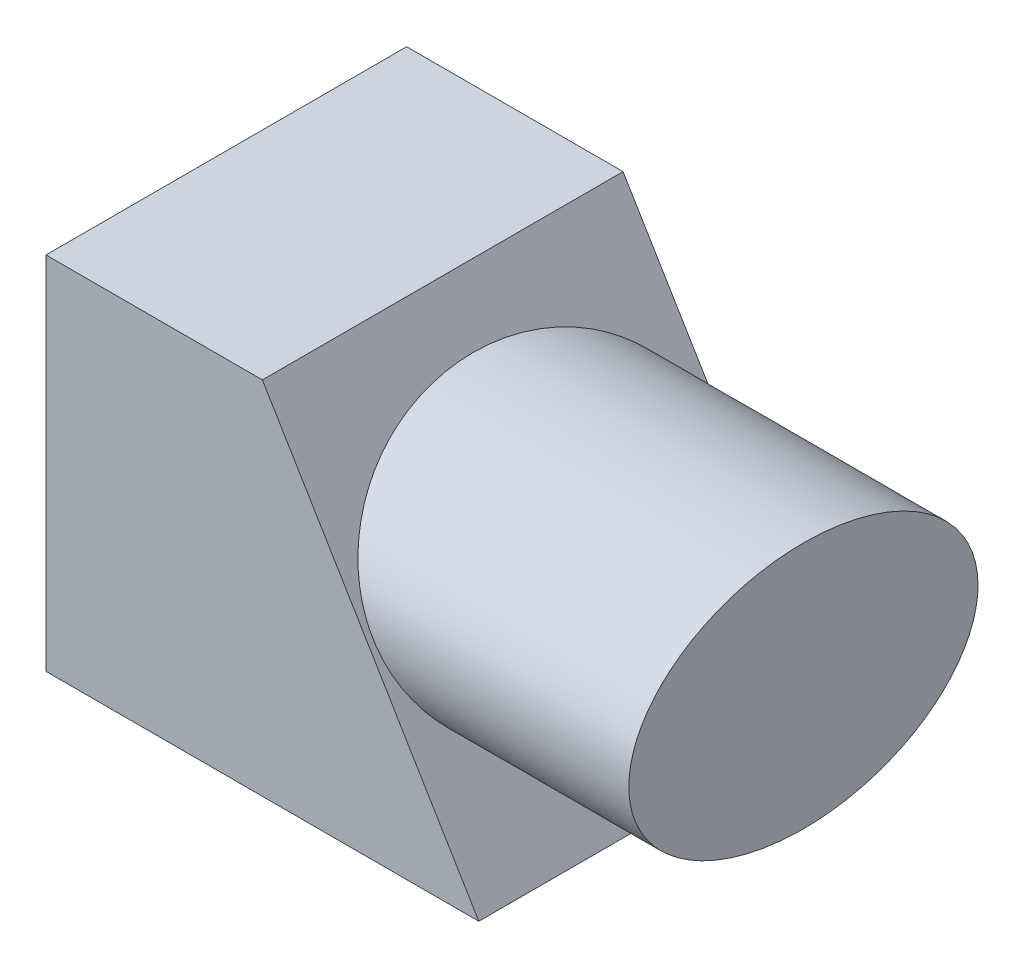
ISO-10303-21;
HEADER;
FILE_DESCRIPTION(('STEP AP214'),'2;1');
FILE_NAME('part.step','',(''),(''),'','','');
FILE_SCHEMA(('AUTOMOTIVE_DESIGN { 1 0 10303 214 1 1 1 1 }'));
ENDSEC;
DATA;
#1=APPLICATION_CONTEXT('core data for automotive mechanical design processes');
#2=APPLICATION_PROTOCOL_DEFINITION('international standard','automotive_design',2000,#1);
#3=PRODUCT_CONTEXT('',#1,'mechanical');
#4=PRODUCT('Part','Part','',(#3));
#5=PRODUCT_RELATED_PRODUCT_CATEGORY('part','',(#4));
#6=PRODUCT_DEFINITION_FORMATION('','',#4);
#7=PRODUCT_DEFINITION_CONTEXT('part definition',#1,'design');
#8=PRODUCT_DEFINITION('design','',#6,#7);
#9=PRODUCT_DEFINITION_SHAPE('','',#8);
#10=(LENGTH_UNIT() NAMED_UNIT(*) SI_UNIT(.MILLI.,.METRE.));
#11=(NAMED_UNIT(*) PLANE_ANGLE_UNIT() SI_UNIT($,.RADIAN.));
#12=(NAMED_UNIT(*) SI_UNIT($,.STERADIAN.) SOLID_ANGLE_UNIT());
#13=UNCERTAINTY_MEASURE_WITH_UNIT(LENGTH_MEASURE(1.E-05),#10,'distance_accuracy_value','');
#14=(GEOMETRIC_REPRESENTATION_CONTEXT(3) GLOBAL_UNCERTAINTY_ASSIGNED_CONTEXT((#13)) GLOBAL_UNIT_ASSIGNED_CONTEXT((#10,
#11,#12)) REPRESENTATION_CONTEXT('',''));
#15=CARTESIAN_POINT('',(0.,0.,0.));
#16=DIRECTION('',(0.,0.,1.));
#17=DIRECTION('',(1.,0.,0.));
#18=AXIS2_PLACEMENT_3D('',#15,#16,#17);
#19=CARTESIAN_POINT('',(0.,50.,25.));
#20=DIRECTION('',(1.,0.,0.));
#21=DIRECTION('',(0.,1.,0.));
#22=AXIS2_PLACEMENT_3D('',#19,#20,#21);
#23=PLANE('',#22);
#24=DIRECTION('',(0.,-1.,0.));
#25=VECTOR('',#24,1.);
#26=CARTESIAN_POINT('',(0.,50.,-25.));
#27=LINE('',#26,#25);
#28=CARTESIAN_POINT('',(0.,50.,-25.));
#29=VERTEX_POINT('',#28);
#30=CARTESIAN_POINT('',(0.,0.,-25.));
#31=VERTEX_POINT('',#30);
#32=EDGE_CURVE('E76',#29,#31,#27,.T.);
#33=ORIENTED_EDGE('',*,*,#32,.T.);
#34=DIRECTION('',(0.,0.,-1.));
#35=VECTOR('',#34,1.);
#36=CARTESIAN_POINT('',(0.,0.,25.));
#37=LINE('',#36,#35);
#38=CARTESIAN_POINT('',(0.,0.,25.));
#39=VERTEX_POINT('',#38);
#40=EDGE_CURVE('E11',#39,#31,#37,.T.);
#41=ORIENTED_EDGE('',*,*,#40,.F.);
#42=DIRECTION('',(0.,-1.,0.));
#43=VECTOR('',#42,1.);
#44=CARTESIAN_POINT('',(0.,50.,25.));
#45=LINE('',#44,#43);
#46=CARTESIAN_POINT('',(0.,50.,25.));
#47=VERTEX_POINT('',#46);
#48=EDGE_CURVE('E100',#47,#39,#45,.T.);
#49=ORIENTED_EDGE('',*,*,#48,.F.);
#50=DIRECTION('',(0.,0.,-1.));
#51=VECTOR('',#50,1.);
#52=CARTESIAN_POINT('',(0.,50.,25.));
#53=LINE('',#52,#51);
#54=EDGE_CURVE('E88',#47,#29,#53,.T.);
#55=ORIENTED_EDGE('',*,*,#54,.T.);
#56=EDGE_LOOP('',(#33,#41,#49,#55));
#57=FACE_BOUND('',#56,.T.);
#58=ADVANCED_FACE('F32',(#57),#23,.F.);
#59=CARTESIAN_POINT('',(0.,0.,25.));
#60=DIRECTION('',(0.,1.,0.));
#61=DIRECTION('',(0.,0.,1.));
#62=AXIS2_PLACEMENT_3D('',#59,#60,#61);
#63=PLANE('',#62);
#64=DIRECTION('',(1.,0.,0.));
#65=VECTOR('',#64,1.);
#66=CARTESIAN_POINT('',(0.,0.,-25.));
#67=LINE('',#66,#65);
#68=CARTESIAN_POINT('',(60.,0.,-25.));
#69=VERTEX_POINT('',#68);
#70=EDGE_CURVE('E72',#31,#69,#67,.T.);
#71=ORIENTED_EDGE('',*,*,#70,.T.);
#72=DIRECTION('',(0.,0.,-1.));
#73=VECTOR('',#72,1.);
#74=CARTESIAN_POINT('',(60.,0.,25.));
#75=LINE('',#74,#73);
#76=CARTESIAN_POINT('',(60.,0.,25.));
#77=VERTEX_POINT('',#76);
#78=EDGE_CURVE('E39',#77,#69,#75,.T.);
#79=ORIENTED_EDGE('',*,*,#78,.F.);
#80=DIRECTION('',(1.,0.,0.));
#81=VECTOR('',#80,1.);
#82=CARTESIAN_POINT('',(0.,0.,25.));
#83=LINE('',#82,#81);
#84=EDGE_CURVE('E84',#39,#77,#83,.T.);
#85=ORIENTED_EDGE('',*,*,#84,.F.);
#86=ORIENTED_EDGE('',*,*,#40,.T.);
#87=EDGE_LOOP('',(#71,#79,#85,#86));
#88=FACE_BOUND('',#87,.T.);
#89=ADVANCED_FACE('F83',(#88),#63,.F.);
#90=CARTESIAN_POINT('',(60.,0.,25.));
#91=DIRECTION('',(-0.857492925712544,-0.514495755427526,0.));
#92=DIRECTION('',(0.514495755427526,-0.857492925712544,0.));
#93=AXIS2_PLACEMENT_3D('',#90,#91,#92);
#94=PLANE('',#93);
#95=CARTESIAN_POINT('',(44.5452397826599,25.7579336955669,-24.2033493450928));
#96=CARTESIAN_POINT('',(44.2784314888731,26.2026141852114,-24.2033426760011));
#97=CARTESIAN_POINT('',(44.0115370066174,26.6474383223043,-24.1789456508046));
#98=CARTESIAN_POINT('',(43.4800117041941,27.5333138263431,-24.081736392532));
#99=CARTESIAN_POINT('',(43.2153820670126,27.9743632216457,-24.008900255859));
#100=CARTESIAN_POINT('',(42.6903117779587,28.8494803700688,-23.8158744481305));
#101=CARTESIAN_POINT('',(42.4298782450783,29.2835362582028,-23.6956116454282));
#102=CARTESIAN_POINT('',(41.9157583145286,30.1404028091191,-23.4096933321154));
#103=CARTESIAN_POINT('',(41.6620707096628,30.5632154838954,-23.2440460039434));
#104=CARTESIAN_POINT('',(41.1850273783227,31.3582877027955,-22.8862175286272));
#105=CARTESIAN_POINT('',(40.9609570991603,31.7317381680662,-22.6976152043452));
#106=CARTESIAN_POINT('',(40.5211097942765,32.4648170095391,-22.2868854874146));
#107=CARTESIAN_POINT('',(40.3053329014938,32.8244451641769,-22.0647575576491));
#108=CARTESIAN_POINT('',(39.8833206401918,33.5277989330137,-21.5896275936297));
#109=CARTESIAN_POINT('',(39.6770746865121,33.8715421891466,-21.3366610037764));
#110=CARTESIAN_POINT('',(39.2747089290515,34.5421517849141,-20.8021648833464));
#111=CARTESIAN_POINT('',(39.07858710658,34.8690214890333,-20.5206410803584));
#112=CARTESIAN_POINT('',(38.67857725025,35.5357045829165,-19.9029057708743));
#113=CARTESIAN_POINT('',(38.4757748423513,35.8737085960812,-19.5640384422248));
#114=CARTESIAN_POINT('',(38.0838048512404,36.5269919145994,-18.8582413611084));
#115=CARTESIAN_POINT('',(37.8946289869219,36.8422850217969,-18.4913289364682));
#116=CARTESIAN_POINT('',(37.530258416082,37.44956930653,-17.732394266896));
#117=CARTESIAN_POINT('',(37.3550597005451,37.7415671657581,-17.3403792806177));
#118=CARTESIAN_POINT('',(37.0188537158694,38.3019104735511,-16.5339580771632));
#119=CARTESIAN_POINT('',(36.8578482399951,38.5702529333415,-16.1195490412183));
#120=CARTESIAN_POINT('',(36.5503088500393,39.0828185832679,-15.2712730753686));
#121=CARTESIAN_POINT('',(36.4037672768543,39.3270545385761,-14.8374166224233));
#122=CARTESIAN_POINT('',(36.1251441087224,39.7914264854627,-13.9525089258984));
#123=CARTESIAN_POINT('',(35.9930638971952,40.0115601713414,-13.5014560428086));
#124=CARTESIAN_POINT('',(35.6897967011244,40.517005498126,-12.3875526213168));
#125=CARTESIAN_POINT('',(35.5261557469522,40.7897404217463,-11.7168877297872));
#126=CARTESIAN_POINT('',(35.2284283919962,41.2859526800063,-10.3511441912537));
#127=CARTESIAN_POINT('',(35.0943507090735,41.5094154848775,-9.65605841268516));
#128=CARTESIAN_POINT('',(34.8557259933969,41.9071233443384,-8.24751944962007));
#129=CARTESIAN_POINT('',(34.7511587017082,42.0814021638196,-7.53407923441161));
#130=CARTESIAN_POINT('',(34.5712958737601,42.3811735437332,-6.09364316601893));
#131=CARTESIAN_POINT('',(34.4959980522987,42.5066699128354,-5.36664837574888));
#132=CARTESIAN_POINT('',(34.3138241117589,42.8102931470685,-3.17263000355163));
#133=CARTESIAN_POINT('',(34.2504349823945,42.9159416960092,-1.69117854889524));
#134=CARTESIAN_POINT('',(34.2395429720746,42.9340950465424,1.27324892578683));
#135=CARTESIAN_POINT('',(34.292035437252,42.8466076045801,2.75622488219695));
#136=CARTESIAN_POINT('',(34.4577928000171,42.5703453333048,4.95501452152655));
#137=CARTESIAN_POINT('',(34.5276001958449,42.4539996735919,5.68399267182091));
#138=CARTESIAN_POINT('',(34.6964394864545,42.1726008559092,7.12925153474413));
#139=CARTESIAN_POINT('',(34.7954718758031,42.0075468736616,7.84553203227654));
#140=CARTESIAN_POINT('',(35.022226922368,41.6296217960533,9.25602295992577));
#141=CARTESIAN_POINT('',(35.1497743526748,41.417042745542,9.95033980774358));
#142=CARTESIAN_POINT('',(35.4340345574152,40.9432757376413,11.316079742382));
#143=CARTESIAN_POINT('',(35.5907449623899,40.6820917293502,11.9875046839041));
#144=CARTESIAN_POINT('',(35.9190246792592,40.1349588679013,13.2464792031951));
#145=CARTESIAN_POINT('',(36.0882465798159,39.8529223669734,13.8363412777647));
#146=CARTESIAN_POINT('',(36.4511855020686,39.2480241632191,14.9869682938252));
#147=CARTESIAN_POINT('',(36.6449015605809,38.9251640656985,15.5477343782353));
#148=CARTESIAN_POINT('',(37.0382356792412,38.2696072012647,16.5861686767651));
#149=CARTESIAN_POINT('',(37.2357903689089,37.9403493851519,17.0667892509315));
#150=CARTESIAN_POINT('',(37.6505876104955,37.2490206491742,17.9945491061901));
#151=CARTESIAN_POINT('',(37.8678214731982,36.8869642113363,18.4417030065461));
#152=CARTESIAN_POINT('',(38.3015323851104,36.1641126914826,19.2602826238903));
#153=CARTESIAN_POINT('',(38.5164092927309,35.8059845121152,19.6349108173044));
#154=CARTESIAN_POINT('',(38.9616558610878,35.063906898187,20.3488708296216));
#155=CARTESIAN_POINT('',(39.1920441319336,34.6799264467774,20.6881589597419));
#156=CARTESIAN_POINT('',(39.6520516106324,33.9132473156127,21.3066300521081));
#157=CARTESIAN_POINT('',(39.8808010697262,33.531998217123,21.5882553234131));
#158=CARTESIAN_POINT('',(40.3497977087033,32.7503371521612,22.1132165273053));
#159=CARTESIAN_POINT('',(40.5900492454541,32.3499179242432,22.3565377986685));
#160=CARTESIAN_POINT('',(41.0803398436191,31.5327669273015,22.8013079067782));
#161=CARTESIAN_POINT('',(41.3303691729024,31.1160513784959,23.0027971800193));
#162=CARTESIAN_POINT('',(41.8386266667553,30.2689555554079,23.3611756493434));
#163=CARTESIAN_POINT('',(42.0968504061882,29.8385826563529,23.5180884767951));
#164=CARTESIAN_POINT('',(42.6083623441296,28.9860627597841,23.7792262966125));
#165=CARTESIAN_POINT('',(42.8613828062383,28.5643619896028,23.8854324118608));
#166=CARTESIAN_POINT('',(43.3713024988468,27.7144958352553,24.0532575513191));
#167=CARTESIAN_POINT('',(43.6282013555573,27.2863310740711,24.1148808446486));
#168=CARTESIAN_POINT('',(44.1249505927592,26.4584156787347,24.1897391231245));
#169=CARTESIAN_POINT('',(44.3646743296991,26.0588761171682,24.2061822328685));
#170=CARTESIAN_POINT('',(44.844060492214,25.2598991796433,24.1997189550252));
#171=CARTESIAN_POINT('',(45.0837228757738,24.8604618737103,24.1768003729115));
#172=CARTESIAN_POINT('',(45.561483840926,24.0641935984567,24.0918549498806));
#173=CARTESIAN_POINT('',(45.79958026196,23.6673662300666,24.0297823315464));
#174=CARTESIAN_POINT('',(46.2722643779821,22.8795593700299,23.8673394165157));
#175=CARTESIAN_POINT('',(46.5068523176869,22.4885794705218,23.7669718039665));
#176=CARTESIAN_POINT('',(46.9719265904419,21.7134556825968,23.528782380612));
#177=CARTESIAN_POINT('',(47.2023929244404,21.3293451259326,23.3908133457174));
#178=CARTESIAN_POINT('',(47.6568674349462,20.5718876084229,23.0793258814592));
#179=CARTESIAN_POINT('',(47.8808754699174,20.198540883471,22.9058066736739));
#180=CARTESIAN_POINT('',(48.3212325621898,19.4646123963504,22.5252302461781));
#181=CARTESIAN_POINT('',(48.5375807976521,19.1040320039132,22.3181694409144));
#182=CARTESIAN_POINT('',(48.96156119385,18.39739801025,21.8727589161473));
#183=CARTESIAN_POINT('',(49.1691931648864,18.0513447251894,21.6344085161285));
#184=CARTESIAN_POINT('',(49.5900088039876,17.3499853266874,21.1099204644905));
#185=CARTESIAN_POINT('',(49.8024542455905,16.9959095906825,20.821545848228));
#186=CARTESIAN_POINT('',(50.2154840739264,16.307526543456,20.2143105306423));
#187=CARTESIAN_POINT('',(50.4160672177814,15.9732213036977,19.895446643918));
#188=CARTESIAN_POINT('',(50.8046534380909,15.3255776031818,19.2302942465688));
#189=CARTESIAN_POINT('',(50.9926613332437,15.0122311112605,18.8840163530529));
#190=CARTESIAN_POINT('',(51.3556873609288,14.4071877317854,18.1668218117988));
#191=CARTESIAN_POINT('',(51.5307080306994,14.115486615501,17.7959100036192));
#192=CARTESIAN_POINT('',(51.8906661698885,13.5155563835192,16.9794796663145));
#193=CARTESIAN_POINT('',(52.0736568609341,13.2105718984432,16.530716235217));
#194=CARTESIAN_POINT('',(52.4220593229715,12.6299011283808,15.6086949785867));
#195=CARTESIAN_POINT('',(52.5874839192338,12.3541934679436,15.135455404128));
#196=CARTESIAN_POINT('',(52.9007257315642,11.8321237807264,14.1676759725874));
#197=CARTESIAN_POINT('',(53.0485481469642,11.5857530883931,13.6731424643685));
#198=CARTESIAN_POINT('',(53.3266269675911,11.1222883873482,12.665628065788));
#199=CARTESIAN_POINT('',(53.4568779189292,10.9052034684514,12.1526415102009));
#200=CARTESIAN_POINT('',(53.7402682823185,10.4328861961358,10.9375811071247));
#201=CARTESIAN_POINT('',(53.8865751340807,10.1890414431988,10.2294520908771));
#202=CARTESIAN_POINT('',(54.1480433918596,9.75326101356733,8.79174600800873));
#203=CARTESIAN_POINT('',(54.2631978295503,9.56133695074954,8.06216418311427));
#204=CARTESIAN_POINT('',(54.4624528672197,9.22924522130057,6.58764346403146));
#205=CARTESIAN_POINT('',(54.5465717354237,9.08904710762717,5.84271387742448));
#206=CARTESIAN_POINT('',(54.684006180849,8.85998969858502,4.34226949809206));
#207=CARTESIAN_POINT('',(54.7373232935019,8.77112784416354,3.58675523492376));
#208=CARTESIAN_POINT('',(54.8132729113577,8.64454514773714,2.0700736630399));
#209=CARTESIAN_POINT('',(54.8359108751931,8.60681520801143,1.30890738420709));
#210=CARTESIAN_POINT('',(54.8505726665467,8.58237888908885,-0.214537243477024));
#211=CARTESIAN_POINT('',(54.8425964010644,8.59567266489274,-0.976815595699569));
#212=CARTESIAN_POINT('',(54.7960094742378,8.67331754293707,-2.49788028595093));
#213=CARTESIAN_POINT('',(54.7573970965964,8.73767150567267,-3.25666642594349));
#214=CARTESIAN_POINT('',(54.6494462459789,8.91758959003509,-4.76597311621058));
#215=CARTESIAN_POINT('',(54.5801073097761,9.03315448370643,-5.51649354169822));
#216=CARTESIAN_POINT('',(54.4105256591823,9.31579056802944,-7.00458025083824));
#217=CARTESIAN_POINT('',(54.3102704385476,9.48288260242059,-7.74214116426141));
#218=CARTESIAN_POINT('',(54.0787013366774,9.8688311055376,-9.19857296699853));
#219=CARTESIAN_POINT('',(53.9473917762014,10.0876803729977,-9.91744644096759));
#220=CARTESIAN_POINT('',(53.6643260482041,10.5594565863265,-11.2789166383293));
#221=CARTESIAN_POINT('',(53.5147724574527,10.8087125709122,-11.9232432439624));
#222=CARTESIAN_POINT('',(53.1887762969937,11.3520395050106,-13.1857619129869));
#223=CARTESIAN_POINT('',(53.0123343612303,11.6461093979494,-13.8039545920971));
#224=CARTESIAN_POINT('',(52.6490653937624,12.2515576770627,-14.956317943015));
#225=CARTESIAN_POINT('',(52.464457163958,12.5592380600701,-15.4931308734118));
#226=CARTESIAN_POINT('',(52.0731269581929,13.2114550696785,-16.5351388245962));
#227=CARTESIAN_POINT('',(51.8664152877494,13.5559745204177,-17.0403484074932));
#228=CARTESIAN_POINT('',(51.4508133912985,14.2486443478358,-17.9703144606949));
#229=CARTESIAN_POINT('',(51.2437890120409,14.5936849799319,-18.3982207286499));
#230=CARTESIAN_POINT('',(50.8119622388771,15.3133962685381,-19.2199501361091));
#231=CARTESIAN_POINT('',(50.5871372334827,15.6881046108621,-19.6137285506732));
#232=CARTESIAN_POINT('',(50.1369385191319,16.4384358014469,-20.336069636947));
#233=CARTESIAN_POINT('',(49.9126816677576,16.8121972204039,-20.6672603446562));
#234=CARTESIAN_POINT('',(49.4505139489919,17.5824767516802,-21.2919764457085));
#235=CARTESIAN_POINT('',(49.2125977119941,17.9790038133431,-21.5854868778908));
#236=CARTESIAN_POINT('',(48.7246891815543,18.7921846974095,-22.1306051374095));
#237=CARTESIAN_POINT('',(48.4747099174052,19.2088168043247,-22.3822569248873));
#238=CARTESIAN_POINT('',(47.9641458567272,20.0597569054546,-22.8402866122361));
#239=CARTESIAN_POINT('',(47.7035676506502,20.4940539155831,-23.0466921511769));
#240=CARTESIAN_POINT('',(47.2100373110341,21.3166044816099,-23.3860949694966));
#241=CARTESIAN_POINT('',(46.9782086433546,21.702985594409,-23.5252818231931));
#242=CARTESIAN_POINT('',(46.5096257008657,22.4839571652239,-23.7658284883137));
#243=CARTESIAN_POINT('',(46.2728760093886,22.8785399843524,-23.8672219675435));
#244=CARTESIAN_POINT('',(45.7887871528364,23.6853547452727,-24.0333954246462));
#245=CARTESIAN_POINT('',(45.5413410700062,24.097764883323,-24.0970142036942));
#246=CARTESIAN_POINT('',(45.1686979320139,24.7188367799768,-24.1607523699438));
#247=CARTESIAN_POINT('',(45.0441701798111,24.9263830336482,-24.1767168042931));
#248=CARTESIAN_POINT('',(44.7948478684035,25.3419202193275,-24.1980180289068));
#249=CARTESIAN_POINT('',(44.6700532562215,25.5499112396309,-24.2033524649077));
#250=CARTESIAN_POINT('',(44.5452397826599,25.7579336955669,-24.2033493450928));
#251=B_SPLINE_CURVE_WITH_KNOTS('',3,(#95,#96,#97,#98,#99,#100,#101,#102,#103,#104,#105,#106,
#107,#108,#109,#110,#111,#112,#113,#114,#115,#116,#117,#118,#119,#120,#121,#122,#123,#124,#125,
#126,#127,#128,#129,#130,#131,#132,#133,#134,#135,#136,#137,#138,#139,#140,#141,#142,#143,#144,
#145,#146,#147,#148,#149,#150,#151,#152,#153,#154,#155,#156,#157,#158,#159,#160,#161,#162,#163,
#164,#165,#166,#167,#168,#169,#170,#171,#172,#173,#174,#175,#176,#177,#178,#179,#180,#181,#182,
#183,#184,#185,#186,#187,#188,#189,#190,#191,#192,#193,#194,#195,#196,#197,#198,#199,#200,#201,
#202,#203,#204,#205,#206,#207,#208,#209,#210,#211,#212,#213,#214,#215,#216,#217,#218,#219,#220,
#221,#222,#223,#224,#225,#226,#227,#228,#229,#230,#231,#232,#233,#234,#235,#236,#237,#238,#239,
#240,#241,#242,#243,#244,#245,#246,#247,#248,#249,#250),.UNSPECIFIED.,.T.,.F.,(4,2,2,2,2,2,2,2,
2,2,2,2,2,2,2,2,2,2,2,2,2,2,2,2,2,2,2,2,2,2,2,2,2,2,2,2,2,2,2,2,2,2,2,2,2,2,2,2,2,2,2,2,2,2,2,2,
2,2,2,2,2,2,2,2,2,2,2,2,2,2,2,2,2,2,2,2,2,4),(0.,1.55546772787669,3.11170361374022,
4.67034864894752,6.22871285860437,7.65103259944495,9.07337512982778,10.4940980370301,
11.9145365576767,13.4724587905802,15.0294261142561,16.5859452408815,18.1426607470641,
19.6985474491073,21.2545828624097,23.4784647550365,25.7030015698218,27.9260075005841,
30.1488398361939,34.5901561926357,39.0312941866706,41.2538959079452,43.4765352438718,
45.6858744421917,47.8950342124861,49.9189726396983,51.9428315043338,53.7863832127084,
55.629124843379,57.3104700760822,58.9938697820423,60.5709898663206,62.1487121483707,
63.7249021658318,65.3002550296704,66.8076393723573,68.3148793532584,69.7119312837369,
71.1094161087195,72.5085378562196,73.9075615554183,75.3121436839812,76.7167565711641,
78.1215197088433,79.5263134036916,81.0357320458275,82.5453085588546,84.0543032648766,
85.563002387,87.2792010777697,88.9941380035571,90.7085671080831,92.4235271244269,
94.7098646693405,96.996713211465,99.282213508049,101.567599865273,103.852579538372,
106.137566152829,108.422680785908,110.707829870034,112.99390455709,115.27966135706,
117.397968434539,119.51622557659,121.4512375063,123.385351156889,125.14562000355,
126.908161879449,128.548608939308,130.189705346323,131.829067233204,133.467424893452,
134.880676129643,136.292665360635,137.746071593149,138.473561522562,139.201212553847),.UNSPECIFIED.);
#252=CARTESIAN_POINT('',(44.5452397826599,25.7579336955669,-24.2033493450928));
#253=VERTEX_POINT('',#252);
#254=EDGE_CURVE('E89',#253,#253,#251,.T.);
#255=ORIENTED_EDGE('',*,*,#254,.F.);
#256=EDGE_LOOP('',(#255));
#257=FACE_BOUND('',#256,.T.);
#258=DIRECTION('',(-0.514495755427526,0.857492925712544,0.));
#259=VECTOR('',#258,1.);
#260=CARTESIAN_POINT('',(60.,0.,-25.));
#261=LINE('',#260,#259);
#262=CARTESIAN_POINT('',(30.,50.,-25.));
#263=VERTEX_POINT('',#262);
#264=EDGE_CURVE('E77',#69,#263,#261,.T.);
#265=ORIENTED_EDGE('',*,*,#264,.T.);
#266=DIRECTION('',(0.,0.,-1.));
#267=VECTOR('',#266,1.);
#268=CARTESIAN_POINT('',(30.,50.,25.));
#269=LINE('',#268,#267);
#270=CARTESIAN_POINT('',(30.,50.,25.));
#271=VERTEX_POINT('',#270);
#272=EDGE_CURVE('E106',#271,#263,#269,.T.);
#273=ORIENTED_EDGE('',*,*,#272,.F.);
#274=DIRECTION('',(-0.514495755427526,0.857492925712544,0.));
#275=VECTOR('',#274,1.);
#276=CARTESIAN_POINT('',(60.,0.,25.));
#277=LINE('',#276,#275);
#278=EDGE_CURVE('E51',#77,#271,#277,.T.);
#279=ORIENTED_EDGE('',*,*,#278,.F.);
#280=ORIENTED_EDGE('',*,*,#78,.T.);
#281=EDGE_LOOP('',(#265,#273,#279,#280));
#282=FACE_BOUND('',#281,.T.);
#283=ADVANCED_FACE('F109',(#257,#282),#94,.F.);
#284=CARTESIAN_POINT('',(30.,50.,25.));
#285=DIRECTION('',(0.,-1.,0.));
#286=DIRECTION('',(1.,0.,0.));
#287=AXIS2_PLACEMENT_3D('',#284,#285,#286);
#288=PLANE('',#287);
#289=DIRECTION('',(-1.,0.,0.));
#290=VECTOR('',#289,1.);
#291=CARTESIAN_POINT('',(30.,50.,-25.));
#292=LINE('',#291,#290);
#293=EDGE_CURVE('E98',#263,#29,#292,.T.);
#294=ORIENTED_EDGE('',*,*,#293,.T.);
#295=ORIENTED_EDGE('',*,*,#54,.F.);
#296=DIRECTION('',(-1.,0.,0.));
#297=VECTOR('',#296,1.);
#298=CARTESIAN_POINT('',(30.,50.,25.));
#299=LINE('',#298,#297);
#300=EDGE_CURVE('E46',#271,#47,#299,.T.);
#301=ORIENTED_EDGE('',*,*,#300,.F.);
#302=ORIENTED_EDGE('',*,*,#272,.T.);
#303=EDGE_LOOP('',(#294,#295,#301,#302));
#304=FACE_BOUND('',#303,.T.);
#305=ADVANCED_FACE('F111',(#304),#288,.F.);
#306=CARTESIAN_POINT('',(0.,0.,25.));
#307=DIRECTION('',(0.,0.,1.));
#308=DIRECTION('',(1.,0.,0.));
#309=AXIS2_PLACEMENT_3D('',#306,#307,#308);
#310=PLANE('',#309);
#311=ORIENTED_EDGE('',*,*,#48,.T.);
#312=ORIENTED_EDGE('',*,*,#84,.T.);
#313=ORIENTED_EDGE('',*,*,#278,.T.);
#314=ORIENTED_EDGE('',*,*,#300,.T.);
#315=EDGE_LOOP('',(#311,#312,#313,#314));
#316=FACE_BOUND('',#315,.T.);
#317=ADVANCED_FACE('F112',(#316),#310,.T.);
#318=CARTESIAN_POINT('',(0.,0.,-25.));
#319=DIRECTION('',(0.,0.,1.));
#320=DIRECTION('',(1.,0.,0.));
#321=AXIS2_PLACEMENT_3D('',#318,#319,#320);
#322=PLANE('',#321);
#323=ORIENTED_EDGE('',*,*,#32,.F.);
#324=ORIENTED_EDGE('',*,*,#293,.F.);
#325=ORIENTED_EDGE('',*,*,#264,.F.);
#326=ORIENTED_EDGE('',*,*,#70,.F.);
#327=EDGE_LOOP('',(#323,#324,#325,#326));
#328=FACE_BOUND('',#327,.T.);
#329=ADVANCED_FACE('F73',(#328),#322,.F.);
#330=CARTESIAN_POINT('',(80.,25.7579336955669,0.));
#331=DIRECTION('',(1.,0.,0.));
#332=DIRECTION('',(0.,0.,-1.));
#333=AXIS2_PLACEMENT_3D('',#330,#331,#332);
#334=PLANE('',#333);
#335=CARTESIAN_POINT('',(80.,25.7579336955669,0.));
#336=DIRECTION('',(1.,0.,0.));
#337=DIRECTION('',(0.,0.,-1.));
#338=AXIS2_PLACEMENT_3D('',#335,#336,#337);
#339=ELLIPSE('',#338,24.2033493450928,17.1677245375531);
#340=CARTESIAN_POINT('',(80.,25.7579336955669,-24.2033493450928));
#341=VERTEX_POINT('',#340);
#342=EDGE_CURVE('E92',#341,#341,#339,.T.);
#343=ORIENTED_EDGE('',*,*,#342,.T.);
#344=EDGE_LOOP('',(#343));
#345=FACE_BOUND('',#344,.T.);
#346=ADVANCED_FACE('F119',(#345),#334,.T.);
#347=CARTESIAN_POINT('',(-19.7338047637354,25.7579336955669,0.));
#348=DIRECTION('',(1.,0.,0.));
#349=DIRECTION('',(0.,0.,-1.));
#350=AXIS2_PLACEMENT_3D('',#347,#348,#349);
#351=ELLIPSE('',#350,24.2033493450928,17.1677245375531);
#352=DIRECTION('',(1.,0.,0.));
#353=VECTOR('',#352,1.);
#354=SURFACE_OF_LINEAR_EXTRUSION('',#351,#353);
#355=ORIENTED_EDGE('',*,*,#342,.F.);
#356=EDGE_LOOP('',(#355));
#357=FACE_BOUND('',#356,.T.);
#358=ORIENTED_EDGE('',*,*,#254,.T.);
#359=EDGE_LOOP('',(#358));
#360=FACE_BOUND('',#359,.T.);
#361=ADVANCED_FACE('F135',(#357,#360),#354,.T.);
#362=CLOSED_SHELL('',(#58,#89,#283,#305,#317,#329,#346,#361));
#363=MANIFOLD_SOLID_BREP('B2',#362);
#364=ADVANCED_BREP_SHAPE_REPRESENTATION('',(#18,#363),#14);
#365=SHAPE_DEFINITION_REPRESENTATION(#9,#364);
ENDSEC;
END-ISO-10303-21;
